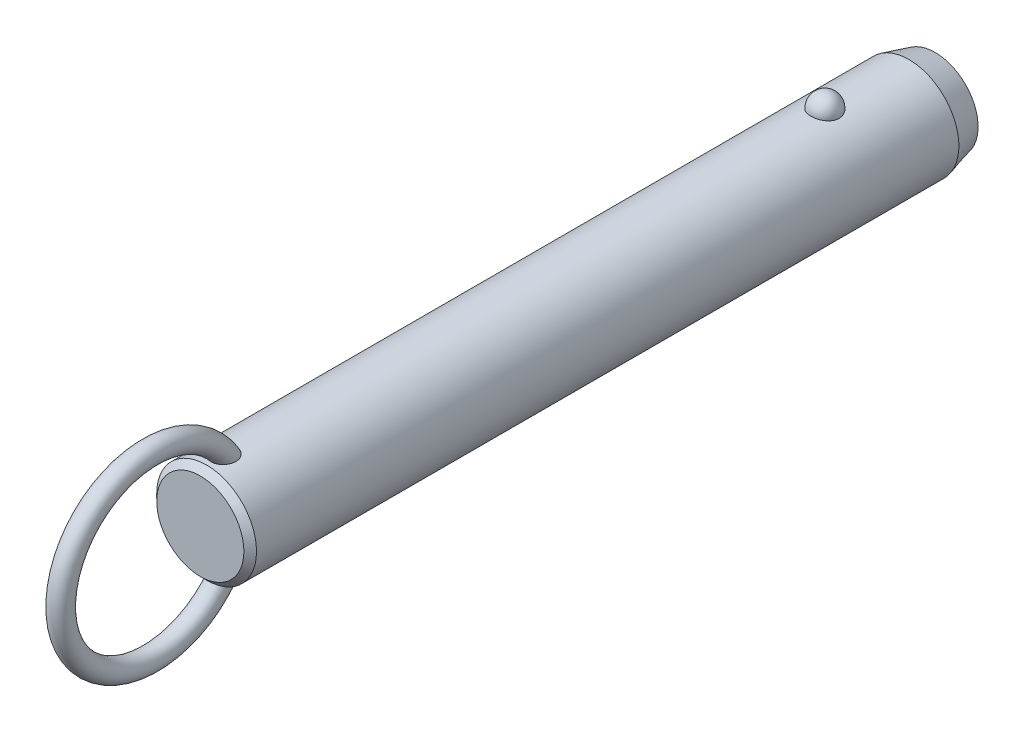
ISO-10303-21;
HEADER;
FILE_DESCRIPTION(('STEP AP214'),'2;1');
FILE_NAME('part.step','',(''),(''),'','','');
FILE_SCHEMA(('AUTOMOTIVE_DESIGN { 1 0 10303 214 1 1 1 1 }'));
ENDSEC;
DATA;
#1=APPLICATION_CONTEXT('core data for automotive mechanical design processes');
#2=APPLICATION_PROTOCOL_DEFINITION('international standard','automotive_design',2000,#1);
#3=PRODUCT_CONTEXT('',#1,'mechanical');
#4=PRODUCT('Part','Part','',(#3));
#5=PRODUCT_RELATED_PRODUCT_CATEGORY('part','',(#4));
#6=PRODUCT_DEFINITION_FORMATION('','',#4);
#7=PRODUCT_DEFINITION_CONTEXT('part definition',#1,'design');
#8=PRODUCT_DEFINITION('design','',#6,#7);
#9=PRODUCT_DEFINITION_SHAPE('','',#8);
#10=(LENGTH_UNIT() NAMED_UNIT(*) SI_UNIT(.MILLI.,.METRE.));
#11=(NAMED_UNIT(*) PLANE_ANGLE_UNIT() SI_UNIT($,.RADIAN.));
#12=(NAMED_UNIT(*) SI_UNIT($,.STERADIAN.) SOLID_ANGLE_UNIT());
#13=UNCERTAINTY_MEASURE_WITH_UNIT(LENGTH_MEASURE(1.E-05),#10,'distance_accuracy_value','');
#14=(GEOMETRIC_REPRESENTATION_CONTEXT(3) GLOBAL_UNCERTAINTY_ASSIGNED_CONTEXT((#13)) GLOBAL_UNIT_ASSIGNED_CONTEXT((#10,
#11,#12)) REPRESENTATION_CONTEXT('',''));
#15=CARTESIAN_POINT('',(0.,0.,0.));
#16=DIRECTION('',(0.,0.,1.));
#17=DIRECTION('',(1.,0.,0.));
#18=AXIS2_PLACEMENT_3D('',#15,#16,#17);
#19=CARTESIAN_POINT('',(0.,0.,106.7));
#20=DIRECTION('',(0.,0.,-1.));
#21=DIRECTION('',(-1.,0.,0.));
#22=AXIS2_PLACEMENT_3D('',#19,#20,#21);
#23=CYLINDRICAL_SURFACE('',#22,9.5);
#24=CARTESIAN_POINT('',(2.67259918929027,9.11631578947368,-2.70000000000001));
#25=CARTESIAN_POINT('',(2.6725968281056,9.11631786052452,-2.54909854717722));
#26=CARTESIAN_POINT('',(2.66030567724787,9.11994722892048,-2.39816735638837));
#27=CARTESIAN_POINT('',(2.6114347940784,9.13405924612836,-2.10058568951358));
#28=CARTESIAN_POINT('',(2.57484658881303,9.14454428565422,-1.95393672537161));
#29=CARTESIAN_POINT('',(2.47830875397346,9.17117631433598,-1.66916069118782));
#30=CARTESIAN_POINT('',(2.41836936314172,9.18732082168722,-1.53102991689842));
#31=CARTESIAN_POINT('',(2.27661331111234,9.22346780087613,-1.26705393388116));
#32=CARTESIAN_POINT('',(2.19479699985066,9.24347021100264,-1.14120852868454));
#33=CARTESIAN_POINT('',(2.01085282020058,9.28522401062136,-0.904632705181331));
#34=CARTESIAN_POINT('',(1.90862396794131,9.30698376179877,-0.793982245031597));
#35=CARTESIAN_POINT('',(1.6867437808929,9.34973971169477,-0.591607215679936));
#36=CARTESIAN_POINT('',(1.56709244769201,9.37073591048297,-0.499882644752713));
#37=CARTESIAN_POINT('',(1.31393976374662,9.40956370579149,-0.338167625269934));
#38=CARTESIAN_POINT('',(1.18048026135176,9.42740444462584,-0.268113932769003));
#39=CARTESIAN_POINT('',(0.903154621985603,9.45799906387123,-0.151390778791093));
#40=CARTESIAN_POINT('',(0.759289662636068,9.47075351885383,-0.10471867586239));
#41=CARTESIAN_POINT('',(0.46807402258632,9.48956256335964,-0.0367633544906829));
#42=CARTESIAN_POINT('',(0.320836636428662,9.49573643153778,-0.0150275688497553));
#43=CARTESIAN_POINT('',(0.02467145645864,9.50112183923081,0.00396199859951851));
#44=CARTESIAN_POINT('',(-0.124256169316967,9.50033406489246,0.00121819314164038));
#45=CARTESIAN_POINT('',(-0.417264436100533,9.4919475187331,-0.0284441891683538));
#46=CARTESIAN_POINT('',(-0.561384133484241,9.48444885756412,-0.055007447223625));
#47=CARTESIAN_POINT('',(-0.842986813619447,9.46357853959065,-0.131064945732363));
#48=CARTESIAN_POINT('',(-0.98046968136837,9.450206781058,-0.180559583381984));
#49=CARTESIAN_POINT('',(-1.24585005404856,9.41890822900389,-0.301476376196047));
#50=CARTESIAN_POINT('',(-1.37368611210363,9.40095498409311,-0.373026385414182));
#51=CARTESIAN_POINT('',(-1.61552738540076,9.36242964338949,-0.536025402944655));
#52=CARTESIAN_POINT('',(-1.72953116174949,9.34185727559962,-0.627476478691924));
#53=CARTESIAN_POINT('',(-1.9429225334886,9.29984568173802,-0.829844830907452));
#54=CARTESIAN_POINT('',(-2.04198021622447,9.27839736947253,-0.94110821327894));
#55=CARTESIAN_POINT('',(-2.2202646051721,9.23735994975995,-1.17883414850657));
#56=CARTESIAN_POINT('',(-2.29948985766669,9.21777097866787,-1.30529781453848));
#57=CARTESIAN_POINT('',(-2.43697287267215,9.18238994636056,-1.57158566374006));
#58=CARTESIAN_POINT('',(-2.49497068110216,9.16664569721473,-1.71155057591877));
#59=CARTESIAN_POINT('',(-2.5872073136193,9.14104303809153,-1.99961197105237));
#60=CARTESIAN_POINT('',(-2.62144683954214,9.13118445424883,-2.14770821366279));
#61=CARTESIAN_POINT('',(-2.66521466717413,9.11850622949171,-2.44715424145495));
#62=CARTESIAN_POINT('',(-2.67484831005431,9.11565658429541,-2.59848735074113));
#63=CARTESIAN_POINT('',(-2.66946735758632,9.11723375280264,-2.90067317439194));
#64=CARTESIAN_POINT('',(-2.65445345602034,9.12166036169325,-3.05152590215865));
#65=CARTESIAN_POINT('',(-2.60029711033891,9.13724422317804,-3.34766110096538));
#66=CARTESIAN_POINT('',(-2.56127978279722,9.14836656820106,-3.49296833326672));
#67=CARTESIAN_POINT('',(-2.46018844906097,9.17606676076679,-3.77477535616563));
#68=CARTESIAN_POINT('',(-2.39811349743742,9.1926448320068,-3.9112747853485));
#69=CARTESIAN_POINT('',(-2.25202303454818,9.22952198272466,-4.17244273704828));
#70=CARTESIAN_POINT('',(-2.16788714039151,9.24984129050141,-4.29704106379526));
#71=CARTESIAN_POINT('',(-1.9799408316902,9.29188255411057,-4.53013066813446));
#72=CARTESIAN_POINT('',(-1.87612963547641,9.31360456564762,-4.63862130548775));
#73=CARTESIAN_POINT('',(-1.65105429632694,9.35612959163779,-4.8369029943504));
#74=CARTESIAN_POINT('',(-1.52972405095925,9.37692871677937,-4.92661991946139));
#75=CARTESIAN_POINT('',(-1.27318250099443,9.41518970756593,-5.08429106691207));
#76=CARTESIAN_POINT('',(-1.13797219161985,9.432651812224,-5.15224684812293));
#77=CARTESIAN_POINT('',(-0.859280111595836,9.46208255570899,-5.26371827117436));
#78=CARTESIAN_POINT('',(-0.715925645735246,9.47411833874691,-5.30753421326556));
#79=CARTESIAN_POINT('',(-0.423550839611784,9.4916822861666,-5.37076321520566));
#80=CARTESIAN_POINT('',(-0.274531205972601,9.49721125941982,-5.39017930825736));
#81=CARTESIAN_POINT('',(0.021844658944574,9.50110860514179,-5.40390587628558));
#82=CARTESIAN_POINT('',(0.169177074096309,9.49961381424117,-5.39869609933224));
#83=CARTESIAN_POINT('',(0.460808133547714,9.48993906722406,-5.36441955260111));
#84=CARTESIAN_POINT('',(0.605106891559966,9.48175936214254,-5.33535367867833));
#85=CARTESIAN_POINT('',(0.886027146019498,9.4596376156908,-5.25435587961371));
#86=CARTESIAN_POINT('',(1.02267710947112,9.44571881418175,-5.20251612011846));
#87=CARTESIAN_POINT('',(1.28523827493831,9.41358993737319,-5.07741549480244));
#88=CARTESIAN_POINT('',(1.41114877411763,9.39537958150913,-5.00415322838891));
#89=CARTESIAN_POINT('',(1.65085227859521,9.3562644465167,-4.83684599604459));
#90=CARTESIAN_POINT('',(1.76442346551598,9.33532178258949,-4.74249218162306));
#91=CARTESIAN_POINT('',(1.97425672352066,9.29321198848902,-4.53620389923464));
#92=CARTESIAN_POINT('',(2.07051582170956,9.27204482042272,-4.42426641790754));
#93=CARTESIAN_POINT('',(2.24490086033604,9.23139221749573,-4.18363183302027));
#94=CARTESIAN_POINT('',(2.32267019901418,9.21194380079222,-4.05466990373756));
#95=CARTESIAN_POINT('',(2.45584092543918,9.1773419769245,-3.78517836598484));
#96=CARTESIAN_POINT('',(2.5112497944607,9.16218713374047,-3.64465264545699));
#97=CARTESIAN_POINT('',(2.59380876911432,9.13913522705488,-3.37104301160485));
#98=CARTESIAN_POINT('',(2.62330266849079,9.13064624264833,-3.23871053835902));
#99=CARTESIAN_POINT('',(2.66269870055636,9.11923566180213,-2.97092664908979));
#100=CARTESIAN_POINT('',(2.67260130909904,9.11631393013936,-2.83547530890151));
#101=CARTESIAN_POINT('',(2.67259918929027,9.11631578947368,-2.70000000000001));
#102=B_SPLINE_CURVE_WITH_KNOTS('',3,(#24,#25,#26,#27,#28,#29,#30,#31,#32,#33,#34,#35,#36,#37,
#38,#39,#40,#41,#42,#43,#44,#45,#46,#47,#48,#49,#50,#51,#52,#53,#54,#55,#56,#57,#58,#59,#60,#61,
#62,#63,#64,#65,#66,#67,#68,#69,#70,#71,#72,#73,#74,#75,#76,#77,#78,#79,#80,#81,#82,#83,#84,#85,
#86,#87,#88,#89,#90,#91,#92,#93,#94,#95,#96,#97,#98,#99,#100,#101),.UNSPECIFIED.,.T.,.F.,(4,2,2,
2,2,2,2,2,2,2,2,2,2,2,2,2,2,2,2,2,2,2,2,2,2,2,2,2,2,2,2,2,2,2,2,2,2,2,4),(0.,0.452217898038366,
0.904593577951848,1.35677112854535,1.80894144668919,2.26340676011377,2.71787203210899,
3.17099820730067,3.62407318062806,4.06878835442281,4.51345969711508,4.95160616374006,
5.38976021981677,5.83050358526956,6.27129275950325,6.72071308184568,7.17016633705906,
7.6249527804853,8.07972578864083,8.53254856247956,8.98535859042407,9.43582813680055,
9.88631615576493,10.3393155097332,10.7923328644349,11.2471065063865,11.7018475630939,
12.150795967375,12.599688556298,13.0398725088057,13.4800399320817,13.9184421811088,
14.3568730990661,14.802202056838,15.2476074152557,15.7010097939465,16.1542603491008,
16.5602594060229,16.966248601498),.UNSPECIFIED.);
#103=CARTESIAN_POINT('',(2.67259918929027,9.11631578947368,-2.70000000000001));
#104=VERTEX_POINT('',#103);
#105=EDGE_CURVE('E41',#104,#104,#102,.T.);
#106=ORIENTED_EDGE('',*,*,#105,.T.);
#107=EDGE_LOOP('',(#106));
#108=FACE_BOUND('',#107,.T.);
#109=CARTESIAN_POINT('',(0.,0.,115.02));
#110=DIRECTION('',(0.,0.,1.));
#111=DIRECTION('',(1.,0.,0.));
#112=AXIS2_PLACEMENT_3D('',#109,#110,#111);
#113=CIRCLE('',#112,9.5);
#114=CARTESIAN_POINT('',(9.5,0.,115.02));
#115=VERTEX_POINT('',#114);
#116=EDGE_CURVE('E10',#115,#115,#113,.F.);
#117=ORIENTED_EDGE('',*,*,#116,.T.);
#118=EDGE_LOOP('',(#117));
#119=FACE_BOUND('',#118,.T.);
#120=CARTESIAN_POINT('',(-0.697062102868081,-9.47439269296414,109.367808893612));
#121=CARTESIAN_POINT('',(-0.799579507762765,-9.46685146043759,109.407482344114));
#122=CARTESIAN_POINT('',(-0.898575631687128,-9.45788043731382,109.4559309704));
#123=CARTESIAN_POINT('',(-1.08670047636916,-9.43811593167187,109.568868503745));
#124=CARTESIAN_POINT('',(-1.17583204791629,-9.42732297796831,109.633352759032));
#125=CARTESIAN_POINT('',(-1.34179806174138,-9.40513672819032,109.776209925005));
#126=CARTESIAN_POINT('',(-1.41865133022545,-9.39374438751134,109.854561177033));
#127=CARTESIAN_POINT('',(-1.5586004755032,-9.37154196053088,110.022752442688));
#128=CARTESIAN_POINT('',(-1.62169476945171,-9.3607319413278,110.11259377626));
#129=CARTESIAN_POINT('',(-1.73527695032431,-9.34035749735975,110.304500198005));
#130=CARTESIAN_POINT('',(-1.7852226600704,-9.33085270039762,110.406891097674));
#131=CARTESIAN_POINT('',(-1.86924997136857,-9.3143834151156,110.618148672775));
#132=CARTESIAN_POINT('',(-1.90332570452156,-9.30741986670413,110.727017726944));
#133=CARTESIAN_POINT('',(-1.95893603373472,-9.29588482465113,110.960473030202));
#134=CARTESIAN_POINT('',(-1.97872420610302,-9.29165182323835,111.085489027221));
#135=CARTESIAN_POINT('',(-2.00062129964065,-9.28695978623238,111.337080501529));
#136=CARTESIAN_POINT('',(-2.00272284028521,-9.28650232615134,111.463656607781));
#137=CARTESIAN_POINT('',(-1.98958876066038,-9.28932750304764,111.736815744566));
#138=CARTESIAN_POINT('',(-1.97143366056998,-9.2932400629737,111.883251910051));
#139=CARTESIAN_POINT('',(-1.91479925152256,-9.30507151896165,112.172062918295));
#140=CARTESIAN_POINT('',(-1.87629122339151,-9.31299607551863,112.314431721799));
#141=CARTESIAN_POINT('',(-1.77225683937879,-9.33340232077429,112.615172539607));
#142=CARTESIAN_POINT('',(-1.70334898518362,-9.34641636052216,112.772369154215));
#143=CARTESIAN_POINT('',(-1.58111062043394,-9.36759153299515,112.997517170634));
#144=CARTESIAN_POINT('',(-1.53721459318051,-9.37492619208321,113.070796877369));
#145=CARTESIAN_POINT('',(-1.4430263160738,-9.38988566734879,113.21307405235));
#146=CARTESIAN_POINT('',(-1.39273721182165,-9.39751033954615,113.282073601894));
#147=CARTESIAN_POINT('',(-1.26775962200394,-9.41530678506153,113.436983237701));
#148=CARTESIAN_POINT('',(-1.19052326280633,-9.42548108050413,113.520871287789));
#149=CARTESIAN_POINT('',(-1.02420241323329,-9.44499825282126,113.676008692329));
#150=CARTESIAN_POINT('',(-0.935139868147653,-9.45434261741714,113.747280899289));
#151=CARTESIAN_POINT('',(-0.766610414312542,-9.46930670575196,113.858695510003));
#152=CARTESIAN_POINT('',(-0.689439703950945,-9.47529223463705,113.902235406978));
#153=CARTESIAN_POINT('',(-0.528942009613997,-9.48560294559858,113.97631336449));
#154=CARTESIAN_POINT('',(-0.445620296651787,-9.48992953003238,114.006862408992));
#155=CARTESIAN_POINT('',(-0.273901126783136,-9.49644161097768,114.052579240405));
#156=CARTESIAN_POINT('',(-0.185465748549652,-9.49860811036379,114.06761059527));
#157=CARTESIAN_POINT('',(-0.00734541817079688,-9.5004135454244,114.080149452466));
#158=CARTESIAN_POINT('',(0.0823387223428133,-9.50005405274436,114.077667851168));
#159=CARTESIAN_POINT('',(0.247679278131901,-9.49708301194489,114.056995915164));
#160=CARTESIAN_POINT('',(0.323620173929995,-9.49477609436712,114.040930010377));
#161=CARTESIAN_POINT('',(0.471981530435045,-9.48855917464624,113.997172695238));
#162=CARTESIAN_POINT('',(0.544400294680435,-9.48464840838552,113.969475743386));
#163=CARTESIAN_POINT('',(0.708947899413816,-9.47398336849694,113.89280266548));
#164=CARTESIAN_POINT('',(0.799149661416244,-9.46671310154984,113.839774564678));
#165=CARTESIAN_POINT('',(0.969783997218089,-9.45076225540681,113.719973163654));
#166=CARTESIAN_POINT('',(1.05019415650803,-9.44207854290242,113.653169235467));
#167=CARTESIAN_POINT('',(1.23092343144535,-9.42051459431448,113.480759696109));
#168=CARTESIAN_POINT('',(1.32652499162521,-9.40733378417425,113.37026193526));
#169=CARTESIAN_POINT('',(1.49893121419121,-9.38140745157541,113.135561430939));
#170=CARTESIAN_POINT('',(1.57571616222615,-9.36866239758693,113.011344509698));
#171=CARTESIAN_POINT('',(1.71285426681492,-9.34457644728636,112.749389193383));
#172=CARTESIAN_POINT('',(1.77266365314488,-9.33328726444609,112.61136233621));
#173=CARTESIAN_POINT('',(1.87239208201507,-9.31379209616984,112.328051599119));
#174=CARTESIAN_POINT('',(1.9123015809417,-9.3055875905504,112.182764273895));
#175=CARTESIAN_POINT('',(1.97604189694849,-9.29228394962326,111.862028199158));
#176=CARTESIAN_POINT('',(1.99587438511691,-9.28797202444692,111.685724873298));
#177=CARTESIAN_POINT('',(2.0029570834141,-9.28645519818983,111.332414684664));
#178=CARTESIAN_POINT('',(1.99025930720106,-9.28923895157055,111.155409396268));
#179=CARTESIAN_POINT('',(1.93735479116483,-9.30038134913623,110.856338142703));
#180=CARTESIAN_POINT('',(1.90576827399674,-9.30697680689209,110.732667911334));
#181=CARTESIAN_POINT('',(1.82287484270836,-9.32356855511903,110.492329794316));
#182=CARTESIAN_POINT('',(1.77158213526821,-9.33356239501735,110.375656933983));
#183=CARTESIAN_POINT('',(1.64885744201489,-9.35602275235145,110.152706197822));
#184=CARTESIAN_POINT('',(1.57730995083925,-9.36850332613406,110.046492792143));
#185=CARTESIAN_POINT('',(1.41543264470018,-9.39431873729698,109.849553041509));
#186=CARTESIAN_POINT('',(1.32510883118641,-9.40765330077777,109.758821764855));
#187=CARTESIAN_POINT('',(1.13846223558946,-9.43195720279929,109.605033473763));
#188=CARTESIAN_POINT('',(1.04369890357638,-9.44302894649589,109.540094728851));
#189=CARTESIAN_POINT('',(0.843965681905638,-9.46296805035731,109.428038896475));
#190=CARTESIAN_POINT('',(0.73900000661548,-9.4718363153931,109.380914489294));
#191=CARTESIAN_POINT('',(0.52817529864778,-9.48586140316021,109.308117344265));
#192=CARTESIAN_POINT('',(0.422686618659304,-9.49119633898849,109.28140249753));
#193=CARTESIAN_POINT('',(0.208590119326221,-9.49831365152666,109.246013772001));
#194=CARTESIAN_POINT('',(0.0999817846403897,-9.500095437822,109.237342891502));
#195=CARTESIAN_POINT('',(-0.126104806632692,-9.49988861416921,109.238350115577));
#196=CARTESIAN_POINT('',(-0.243578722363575,-9.49757821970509,109.249594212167));
#197=CARTESIAN_POINT('',(-0.474390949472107,-9.48885165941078,109.293167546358));
#198=CARTESIAN_POINT('',(-0.587729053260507,-9.48243528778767,109.325497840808));
#199=CARTESIAN_POINT('',(-0.697062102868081,-9.47439269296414,109.367808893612));
#200=B_SPLINE_CURVE_WITH_KNOTS('',3,(#120,#121,#122,#123,#124,#125,#126,#127,#128,#129,#130,
#131,#132,#133,#134,#135,#136,#137,#138,#139,#140,#141,#142,#143,#144,#145,#146,#147,#148,#149,
#150,#151,#152,#153,#154,#155,#156,#157,#158,#159,#160,#161,#162,#163,#164,#165,#166,#167,#168,
#169,#170,#171,#172,#173,#174,#175,#176,#177,#178,#179,#180,#181,#182,#183,#184,#185,#186,#187,
#188,#189,#190,#191,#192,#193,#194,#195,#196,#197,#198,#199),.UNSPECIFIED.,.T.,.F.,(4,2,2,2,2,2,
2,2,2,2,2,2,2,2,2,2,2,2,2,2,2,2,2,2,2,2,2,2,2,2,2,2,2,2,2,2,2,2,2,4),(0.,0.330119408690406,
0.660143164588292,0.989655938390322,1.31920659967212,1.66074728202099,2.00241415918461,
2.38088696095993,2.75951768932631,3.20065679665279,3.6424200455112,4.15620996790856,
4.4131416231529,4.66994734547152,5.01228664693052,5.35399933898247,5.61943037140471,
5.88463652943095,6.15215502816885,6.41950709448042,6.65144391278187,6.88349136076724,
7.19641200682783,7.51003602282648,7.9477971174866,8.38601491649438,8.83699707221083,
9.28819530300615,9.81778662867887,10.3465317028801,10.7284172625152,11.110028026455,
11.4938603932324,11.8775702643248,12.2220189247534,12.5663259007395,12.8915939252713,
13.2169159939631,13.5689650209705,13.9210316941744),.UNSPECIFIED.);
#201=CARTESIAN_POINT('',(-0.697062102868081,-9.47439269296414,109.367808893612));
#202=VERTEX_POINT('',#201);
#203=EDGE_CURVE('E59',#202,#202,#200,.T.);
#204=ORIENTED_EDGE('',*,*,#203,.T.);
#205=EDGE_LOOP('',(#204));
#206=FACE_BOUND('',#205,.T.);
#207=CARTESIAN_POINT('',(-0.697062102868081,9.47439269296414,109.367808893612));
#208=CARTESIAN_POINT('',(-0.597792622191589,9.48169483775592,109.32939564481));
#209=CARTESIAN_POINT('',(-0.495106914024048,9.48766580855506,109.299168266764));
#210=CARTESIAN_POINT('',(-0.285876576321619,9.49627648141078,109.256032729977));
#211=CARTESIAN_POINT('',(-0.179324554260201,9.49890941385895,109.243159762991));
#212=CARTESIAN_POINT('',(0.0344157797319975,9.50053798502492,109.235166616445));
#213=CARTESIAN_POINT('',(0.141603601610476,9.49953613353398,109.240034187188));
#214=CARTESIAN_POINT('',(0.353563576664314,9.49401038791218,109.267365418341));
#215=CARTESIAN_POINT('',(0.458336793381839,9.48948807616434,109.28982117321));
#216=CARTESIAN_POINT('',(0.66249373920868,9.4774236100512,109.351671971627));
#217=CARTESIAN_POINT('',(0.761881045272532,9.46988348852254,109.391055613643));
#218=CARTESIAN_POINT('',(0.952608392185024,9.45260382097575,109.485634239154));
#219=CARTESIAN_POINT('',(1.04394806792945,9.44286417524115,109.540829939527));
#220=CARTESIAN_POINT('',(1.21712767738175,9.4221176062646,109.666066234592));
#221=CARTESIAN_POINT('',(1.29885671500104,9.41109835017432,109.736257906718));
#222=CARTESIAN_POINT('',(1.44978975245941,9.38903310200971,109.888980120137));
#223=CARTESIAN_POINT('',(1.51899278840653,9.37798710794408,109.971511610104));
#224=CARTESIAN_POINT('',(1.64602857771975,9.35654375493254,110.149776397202));
#225=CARTESIAN_POINT('',(1.70333052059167,9.34618688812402,110.245891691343));
#226=CARTESIAN_POINT('',(1.80259341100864,9.32755128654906,110.445897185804));
#227=CARTESIAN_POINT('',(1.84454942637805,9.31927322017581,110.549789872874));
#228=CARTESIAN_POINT('',(1.91637039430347,9.30478365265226,110.772213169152));
#229=CARTESIAN_POINT('',(1.944805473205,9.29882552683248,110.891219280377));
#230=CARTESIAN_POINT('',(1.98449865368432,9.29043398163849,111.132143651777));
#231=CARTESIAN_POINT('',(1.99574908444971,9.28800213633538,111.254063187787));
#232=CARTESIAN_POINT('',(2.00275141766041,9.28649645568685,111.516932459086));
#233=CARTESIAN_POINT('',(1.99588238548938,9.28799035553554,111.657952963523));
#234=CARTESIAN_POINT('',(1.96270559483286,9.29505517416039,111.937621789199));
#235=CARTESIAN_POINT('',(1.93637872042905,9.30063010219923,112.076267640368));
#236=CARTESIAN_POINT('',(1.85949176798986,9.31633564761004,112.372561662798));
#237=CARTESIAN_POINT('',(1.80549792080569,9.3270926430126,112.529290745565));
#238=CARTESIAN_POINT('',(1.67376869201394,9.35163064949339,112.832284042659));
#239=CARTESIAN_POINT('',(1.59603181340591,9.36541185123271,112.978547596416));
#240=CARTESIAN_POINT('',(1.4360277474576,9.39110706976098,113.225813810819));
#241=CARTESIAN_POINT('',(1.35831795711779,9.40278656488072,113.329791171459));
#242=CARTESIAN_POINT('',(1.18774483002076,9.42585025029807,113.524534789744));
#243=CARTESIAN_POINT('',(1.09490932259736,9.43723493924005,113.615324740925));
#244=CARTESIAN_POINT('',(0.921110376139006,9.45552616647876,113.75620334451));
#245=CARTESIAN_POINT('',(0.843738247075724,9.46281058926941,113.810656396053));
#246=CARTESIAN_POINT('',(0.681245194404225,9.47589120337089,113.906711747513));
#247=CARTESIAN_POINT('',(0.596135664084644,9.48168953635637,113.948332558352));
#248=CARTESIAN_POINT('',(0.433779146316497,9.49038144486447,114.010089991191));
#249=CARTESIAN_POINT('',(0.357459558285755,9.49359170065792,114.03260136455));
#250=CARTESIAN_POINT('',(0.20207411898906,9.49816761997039,114.064574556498));
#251=CARTESIAN_POINT('',(0.123010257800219,9.49953459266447,114.074045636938));
#252=CARTESIAN_POINT('',(-0.0357372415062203,9.50026497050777,114.079114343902));
#253=CARTESIAN_POINT('',(-0.115421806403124,9.49962433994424,114.074684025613));
#254=CARTESIAN_POINT('',(-0.272823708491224,9.49640854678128,114.052296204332));
#255=CARTESIAN_POINT('',(-0.350540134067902,9.4938325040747,114.034332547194));
#256=CARTESIAN_POINT('',(-0.500580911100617,9.4870946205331,113.986802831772));
#257=CARTESIAN_POINT('',(-0.572979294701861,9.48296359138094,113.957461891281));
#258=CARTESIAN_POINT('',(-0.712864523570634,9.47347609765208,113.889008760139));
#259=CARTESIAN_POINT('',(-0.780349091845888,9.46811906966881,113.849892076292));
#260=CARTESIAN_POINT('',(-0.946309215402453,9.45329720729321,113.739432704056));
#261=CARTESIAN_POINT('',(-1.04090230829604,9.44321512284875,113.662329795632));
#262=CARTESIAN_POINT('',(-1.21661929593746,9.42219227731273,113.49409718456));
#263=CARTESIAN_POINT('',(-1.29770519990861,9.41124921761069,113.402929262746));
#264=CARTESIAN_POINT('',(-1.47319646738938,9.38563439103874,113.176162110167));
#265=CARTESIAN_POINT('',(-1.5620887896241,9.37102009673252,113.036289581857));
#266=CARTESIAN_POINT('',(-1.71623987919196,9.34401559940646,112.743950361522));
#267=CARTESIAN_POINT('',(-1.78147866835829,9.33162728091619,112.591473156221));
#268=CARTESIAN_POINT('',(-1.88853837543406,9.31055541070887,112.275647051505));
#269=CARTESIAN_POINT('',(-1.92998995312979,9.30193076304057,112.112168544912));
#270=CARTESIAN_POINT('',(-1.98590726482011,9.29015757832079,111.780526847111));
#271=CARTESIAN_POINT('',(-2.0004070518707,9.2870021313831,111.612369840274));
#272=CARTESIAN_POINT('',(-1.99964701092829,9.28716218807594,111.305080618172));
#273=CARTESIAN_POINT('',(-1.98908145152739,9.28945704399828,111.165936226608));
#274=CARTESIAN_POINT('',(-1.94566294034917,9.29865169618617,110.891153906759));
#275=CARTESIAN_POINT('',(-1.91282062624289,9.30554929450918,110.755514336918));
#276=CARTESIAN_POINT('',(-1.84582133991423,9.31898248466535,110.557802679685));
#277=CARTESIAN_POINT('',(-1.82038084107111,9.32400364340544,110.492583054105));
#278=CARTESIAN_POINT('',(-1.76350511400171,9.33492884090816,110.364903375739));
#279=CARTESIAN_POINT('',(-1.73207305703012,9.34083241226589,110.302441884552));
#280=CARTESIAN_POINT('',(-1.66324243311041,9.353333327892,110.18094078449));
#281=CARTESIAN_POINT('',(-1.625842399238,9.35993084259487,110.121902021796));
#282=CARTESIAN_POINT('',(-1.54527678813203,9.37356864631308,110.007987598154));
#283=CARTESIAN_POINT('',(-1.50211241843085,9.38060884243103,109.953111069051));
#284=CARTESIAN_POINT('',(-1.37681147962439,9.40004442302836,109.809961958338));
#285=CARTESIAN_POINT('',(-1.28916358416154,9.41261047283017,109.726429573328));
#286=CARTESIAN_POINT('',(-1.09996826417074,9.43658180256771,109.577236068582));
#287=CARTESIAN_POINT('',(-0.99846185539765,9.44799034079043,109.511523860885));
#288=CARTESIAN_POINT('',(-0.860188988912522,9.46103017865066,109.4394367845));
#289=CARTESIAN_POINT('',(-0.828141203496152,9.46389141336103,109.423851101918));
#290=CARTESIAN_POINT('',(-0.763210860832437,9.46934915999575,109.394473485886));
#291=CARTESIAN_POINT('',(-0.730328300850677,9.47194567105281,109.380681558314));
#292=CARTESIAN_POINT('',(-0.697062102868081,9.47439269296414,109.367808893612));
#293=B_SPLINE_CURVE_WITH_KNOTS('',3,(#207,#208,#209,#210,#211,#212,#213,#214,#215,#216,#217,
#218,#219,#220,#221,#222,#223,#224,#225,#226,#227,#228,#229,#230,#231,#232,#233,#234,#235,#236,
#237,#238,#239,#240,#241,#242,#243,#244,#245,#246,#247,#248,#249,#250,#251,#252,#253,#254,#255,
#256,#257,#258,#259,#260,#261,#262,#263,#264,#265,#266,#267,#268,#269,#270,#271,#272,#273,#274,
#275,#276,#277,#278,#279,#280,#281,#282,#283,#284,#285,#286,#287,#288,#289,#290,#291,#292),
.UNSPECIFIED.,.T.,.F.,(4,2,2,2,2,2,2,2,2,2,2,2,2,2,2,2,2,2,2,2,2,2,2,2,2,2,2,2,2,2,2,2,2,2,2,2,
2,2,2,2,2,2,4),(0.,0.319942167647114,0.640532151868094,0.960900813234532,1.28112555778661,
1.60113495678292,1.92115886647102,2.24457323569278,2.56801248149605,2.90371927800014,
3.23953387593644,3.60560313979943,3.97183576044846,4.393836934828,4.81625324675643,
5.31257045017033,5.80891895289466,6.19868344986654,6.58773876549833,6.87145417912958,
7.15475838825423,7.3926375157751,7.63034760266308,7.86853584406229,8.10683246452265,
8.3406366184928,8.57454843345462,8.93983939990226,9.30614105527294,9.80266668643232,
10.2996107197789,10.8040753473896,11.3079021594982,11.7249776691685,12.1418541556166,
12.3521485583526,12.5623319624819,12.7725671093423,12.9827582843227,13.3458276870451,
13.7078449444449,13.8150604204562,13.9222762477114),.UNSPECIFIED.);
#294=CARTESIAN_POINT('',(-0.697062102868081,9.47439269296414,109.367808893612));
#295=VERTEX_POINT('',#294);
#296=EDGE_CURVE('E67',#295,#295,#293,.T.);
#297=ORIENTED_EDGE('',*,*,#296,.T.);
#298=EDGE_LOOP('',(#297));
#299=FACE_BOUND('',#298,.T.);
#300=CARTESIAN_POINT('',(0.,0.,-18.7000000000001));
#301=DIRECTION('',(0.,0.,-1.));
#302=DIRECTION('',(-1.,0.,0.));
#303=AXIS2_PLACEMENT_3D('',#300,#301,#302);
#304=CIRCLE('',#303,9.5);
#305=CARTESIAN_POINT('',(-9.5,0.,-18.7000000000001));
#306=VERTEX_POINT('',#305);
#307=EDGE_CURVE('E56',#306,#306,#304,.F.);
#308=ORIENTED_EDGE('',*,*,#307,.T.);
#309=EDGE_LOOP('',(#308));
#310=FACE_BOUND('',#309,.T.);
#311=ADVANCED_FACE('F37',(#108,#119,#206,#299,#310),#23,.T.);
#312=CARTESIAN_POINT('',(0.,0.,-23.7));
#313=DIRECTION('',(0.,0.,-1.));
#314=DIRECTION('',(-1.,0.,0.));
#315=AXIS2_PLACEMENT_3D('',#312,#313,#314);
#316=PLANE('',#315);
#317=CARTESIAN_POINT('',(0.,0.,-23.7));
#318=DIRECTION('',(0.,0.,-1.));
#319=DIRECTION('',(-1.,0.,0.));
#320=AXIS2_PLACEMENT_3D('',#317,#318,#319);
#321=CIRCLE('',#320,8.16025403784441);
#322=CARTESIAN_POINT('',(-8.16025403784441,0.,-23.7));
#323=VERTEX_POINT('',#322);
#324=EDGE_CURVE('E66',#323,#323,#321,.T.);
#325=ORIENTED_EDGE('',*,*,#324,.T.);
#326=EDGE_LOOP('',(#325));
#327=FACE_BOUND('',#326,.T.);
#328=ADVANCED_FACE('F85',(#327),#316,.T.);
#329=CARTESIAN_POINT('',(0.,0.,-23.7));
#330=DIRECTION('',(0.,0.,1.));
#331=DIRECTION('',(1.,0.,0.));
#332=AXIS2_PLACEMENT_3D('',#329,#330,#331);
#333=CONICAL_SURFACE('',#332,8.1602540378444,0.261799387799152);
#334=ORIENTED_EDGE('',*,*,#307,.F.);
#335=EDGE_LOOP('',(#334));
#336=FACE_BOUND('',#335,.T.);
#337=ORIENTED_EDGE('',*,*,#324,.F.);
#338=EDGE_LOOP('',(#337));
#339=FACE_BOUND('',#338,.T.);
#340=ADVANCED_FACE('F83',(#336,#339),#333,.T.);
#341=CARTESIAN_POINT('',(0.,0.,116.22));
#342=DIRECTION('',(0.,0.,1.));
#343=DIRECTION('',(1.,0.,0.));
#344=AXIS2_PLACEMENT_3D('',#341,#342,#343);
#345=PLANE('',#344);
#346=CARTESIAN_POINT('',(0.,0.,116.22));
#347=DIRECTION('',(0.,0.,1.));
#348=DIRECTION('',(1.,0.,0.));
#349=AXIS2_PLACEMENT_3D('',#346,#347,#348);
#350=CIRCLE('',#349,8.30000000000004);
#351=CARTESIAN_POINT('',(8.30000000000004,0.,116.22));
#352=VERTEX_POINT('',#351);
#353=EDGE_CURVE('E50',#352,#352,#350,.T.);
#354=ORIENTED_EDGE('',*,*,#353,.T.);
#355=EDGE_LOOP('',(#354));
#356=FACE_BOUND('',#355,.T.);
#357=ADVANCED_FACE('F77',(#356),#345,.T.);
#358=CARTESIAN_POINT('',(0.,0.,125.75));
#359=DIRECTION('',(1.,0.,0.));
#360=DIRECTION('',(0.,0.,-1.));
#361=AXIS2_PLACEMENT_3D('',#358,#359,#360);
#362=TOROIDAL_SURFACE('',#361,17.05,2.);
#363=ORIENTED_EDGE('',*,*,#296,.F.);
#364=EDGE_LOOP('',(#363));
#365=FACE_BOUND('',#364,.T.);
#366=ORIENTED_EDGE('',*,*,#203,.F.);
#367=EDGE_LOOP('',(#366));
#368=FACE_BOUND('',#367,.T.);
#369=ADVANCED_FACE('F73',(#365,#368),#362,.T.);
#370=CARTESIAN_POINT('',(0.,0.,116.22));
#371=DIRECTION('',(0.,0.,-1.));
#372=DIRECTION('',(-1.,0.,0.));
#373=AXIS2_PLACEMENT_3D('',#370,#371,#372);
#374=CONICAL_SURFACE('',#373,8.30000000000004,0.785398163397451);
#375=ORIENTED_EDGE('',*,*,#116,.F.);
#376=EDGE_LOOP('',(#375));
#377=FACE_BOUND('',#376,.T.);
#378=ORIENTED_EDGE('',*,*,#353,.F.);
#379=EDGE_LOOP('',(#378));
#380=FACE_BOUND('',#379,.T.);
#381=ADVANCED_FACE('F39',(#377,#380),#374,.T.);
#382=CARTESIAN_POINT('',(0.,9.5,-2.70000000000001));
#383=DIRECTION('',(0.,1.,0.));
#384=DIRECTION('',(0.,0.,-1.));
#385=AXIS2_PLACEMENT_3D('',#382,#383,#384);
#386=SPHERICAL_SURFACE('',#385,2.7);
#387=ORIENTED_EDGE('',*,*,#105,.F.);
#388=EDGE_LOOP('',(#387));
#389=FACE_BOUND('',#388,.T.);
#390=ADVANCED_FACE('F79',(#389),#386,.T.);
#391=CLOSED_SHELL('',(#311,#328,#340,#357,#369,#381,#390));
#392=MANIFOLD_SOLID_BREP('B2',#391);
#393=ADVANCED_BREP_SHAPE_REPRESENTATION('',(#18,#392),#14);
#394=SHAPE_DEFINITION_REPRESENTATION(#9,#393);
ENDSEC;
END-ISO-10303-21;
